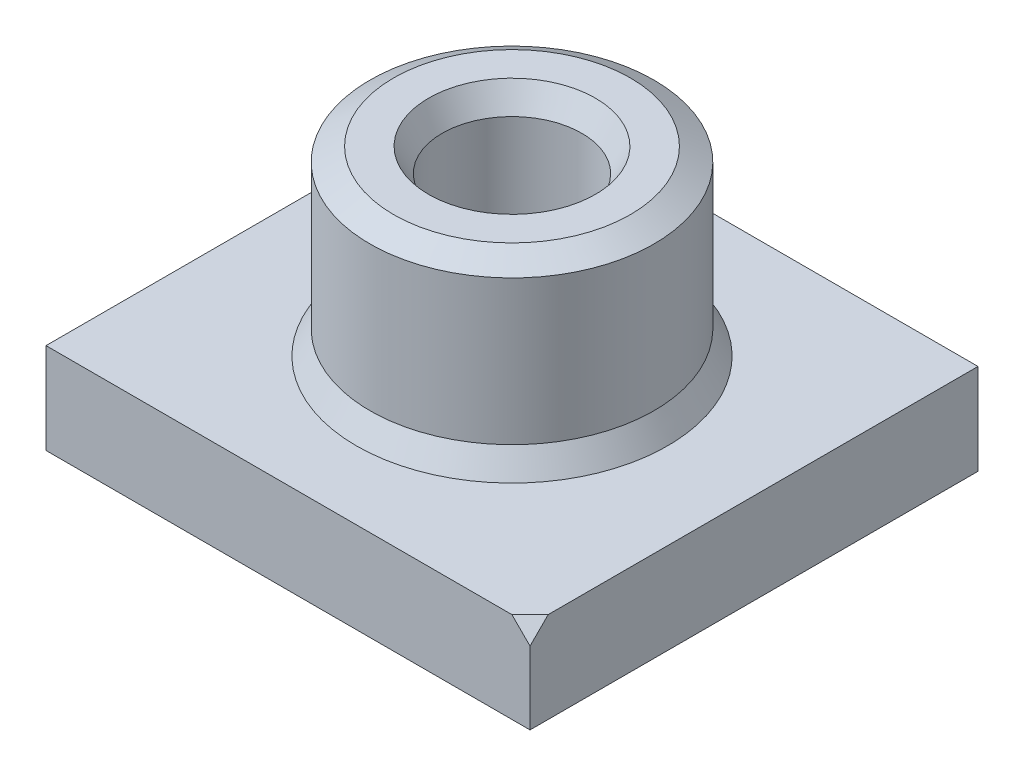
ISO-10303-21;
HEADER;
FILE_DESCRIPTION(('STEP AP214'),'2;1');
FILE_NAME('part.step','',(''),(''),'','','');
FILE_SCHEMA(('AUTOMOTIVE_DESIGN { 1 0 10303 214 1 1 1 1 }'));
ENDSEC;
DATA;
#1=APPLICATION_CONTEXT('core data for automotive mechanical design processes');
#2=APPLICATION_PROTOCOL_DEFINITION('international standard','automotive_design',2000,#1);
#3=PRODUCT_CONTEXT('',#1,'mechanical');
#4=PRODUCT('Part','Part','',(#3));
#5=PRODUCT_RELATED_PRODUCT_CATEGORY('part','',(#4));
#6=PRODUCT_DEFINITION_FORMATION('','',#4);
#7=PRODUCT_DEFINITION_CONTEXT('part definition',#1,'design');
#8=PRODUCT_DEFINITION('design','',#6,#7);
#9=PRODUCT_DEFINITION_SHAPE('','',#8);
#10=(LENGTH_UNIT() NAMED_UNIT(*) SI_UNIT(.MILLI.,.METRE.));
#11=(NAMED_UNIT(*) PLANE_ANGLE_UNIT() SI_UNIT($,.RADIAN.));
#12=(NAMED_UNIT(*) SI_UNIT($,.STERADIAN.) SOLID_ANGLE_UNIT());
#13=UNCERTAINTY_MEASURE_WITH_UNIT(LENGTH_MEASURE(1.E-05),#10,'distance_accuracy_value','');
#14=(GEOMETRIC_REPRESENTATION_CONTEXT(3) GLOBAL_UNCERTAINTY_ASSIGNED_CONTEXT((#13)) GLOBAL_UNIT_ASSIGNED_CONTEXT((#10,
#11,#12)) REPRESENTATION_CONTEXT('',''));
#15=CARTESIAN_POINT('',(0.,0.,0.));
#16=DIRECTION('',(0.,0.,1.));
#17=DIRECTION('',(1.,0.,0.));
#18=AXIS2_PLACEMENT_3D('',#15,#16,#17);
#19=CARTESIAN_POINT('',(67.6797797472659,25.4,-62.6367580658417));
#20=DIRECTION('',(-1.,0.,0.));
#21=DIRECTION('',(0.,0.,1.));
#22=AXIS2_PLACEMENT_3D('',#19,#20,#21);
#23=PLANE('',#22);
#24=DIRECTION('',(0.,0.,-1.));
#25=VECTOR('',#24,1.);
#26=CARTESIAN_POINT('',(67.6797797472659,25.4,-62.6367580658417));
#27=LINE('',#26,#25);
#28=CARTESIAN_POINT('',(67.6797797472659,25.4,57.5567580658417));
#29=VERTEX_POINT('',#28);
#30=CARTESIAN_POINT('',(67.6797797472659,25.4,-62.6367580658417));
#31=VERTEX_POINT('',#30);
#32=EDGE_CURVE('E83',#29,#31,#27,.T.);
#33=ORIENTED_EDGE('',*,*,#32,.F.);
#34=DIRECTION('',(0.,-0.707106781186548,0.707106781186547));
#35=VECTOR('',#34,1.);
#36=CARTESIAN_POINT('',(67.6797797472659,85.4967580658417,-2.53999999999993));
#37=LINE('',#36,#35);
#38=CARTESIAN_POINT('',(67.6797797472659,20.32,62.6367580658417));
#39=VERTEX_POINT('',#38);
#40=EDGE_CURVE('E72',#29,#39,#37,.T.);
#41=ORIENTED_EDGE('',*,*,#40,.T.);
#42=DIRECTION('',(0.,-1.,0.));
#43=VECTOR('',#42,1.);
#44=CARTESIAN_POINT('',(67.6797797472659,25.4,62.6367580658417));
#45=LINE('',#44,#43);
#46=CARTESIAN_POINT('',(67.6797797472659,0.,62.6367580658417));
#47=VERTEX_POINT('',#46);
#48=EDGE_CURVE('E100',#39,#47,#45,.T.);
#49=ORIENTED_EDGE('',*,*,#48,.T.);
#50=DIRECTION('',(0.,0.,-1.));
#51=VECTOR('',#50,1.);
#52=CARTESIAN_POINT('',(67.6797797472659,0.,-62.6367580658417));
#53=LINE('',#52,#51);
#54=CARTESIAN_POINT('',(67.6797797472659,0.,-62.6367580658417));
#55=VERTEX_POINT('',#54);
#56=EDGE_CURVE('E157',#47,#55,#53,.T.);
#57=ORIENTED_EDGE('',*,*,#56,.T.);
#58=DIRECTION('',(0.,-1.,0.));
#59=VECTOR('',#58,1.);
#60=CARTESIAN_POINT('',(67.6797797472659,25.4,-62.6367580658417));
#61=LINE('',#60,#59);
#62=EDGE_CURVE('E89',#31,#55,#61,.T.);
#63=ORIENTED_EDGE('',*,*,#62,.F.);
#64=EDGE_LOOP('',(#33,#41,#49,#57,#63));
#65=FACE_BOUND('',#64,.T.);
#66=ADVANCED_FACE('F27',(#65),#23,.F.);
#67=CARTESIAN_POINT('',(-67.6797797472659,25.4,62.6367580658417));
#68=DIRECTION('',(0.,0.,-1.));
#69=DIRECTION('',(-1.,0.,0.));
#70=AXIS2_PLACEMENT_3D('',#67,#68,#69);
#71=PLANE('',#70);
#72=ORIENTED_EDGE('',*,*,#48,.F.);
#73=DIRECTION('',(-0.707106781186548,0.707106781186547,0.));
#74=VECTOR('',#73,1.);
#75=CARTESIAN_POINT('',(-2.54000000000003,90.5397797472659,62.6367580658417));
#76=LINE('',#75,#74);
#77=CARTESIAN_POINT('',(62.5997797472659,25.4,62.6367580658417));
#78=VERTEX_POINT('',#77);
#79=EDGE_CURVE('E42',#39,#78,#76,.T.);
#80=ORIENTED_EDGE('',*,*,#79,.T.);
#81=DIRECTION('',(1.,0.,0.));
#82=VECTOR('',#81,1.);
#83=CARTESIAN_POINT('',(-67.6797797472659,25.4,62.6367580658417));
#84=LINE('',#83,#82);
#85=CARTESIAN_POINT('',(-67.6797797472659,25.4,62.6367580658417));
#86=VERTEX_POINT('',#85);
#87=EDGE_CURVE('E85',#86,#78,#84,.T.);
#88=ORIENTED_EDGE('',*,*,#87,.F.);
#89=DIRECTION('',(0.,-1.,0.));
#90=VECTOR('',#89,1.);
#91=CARTESIAN_POINT('',(-67.6797797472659,25.4,62.6367580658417));
#92=LINE('',#91,#90);
#93=CARTESIAN_POINT('',(-67.6797797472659,0.,62.6367580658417));
#94=VERTEX_POINT('',#93);
#95=EDGE_CURVE('E86',#86,#94,#92,.T.);
#96=ORIENTED_EDGE('',*,*,#95,.T.);
#97=DIRECTION('',(1.,0.,0.));
#98=VECTOR('',#97,1.);
#99=CARTESIAN_POINT('',(-67.6797797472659,0.,62.6367580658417));
#100=LINE('',#99,#98);
#101=EDGE_CURVE('E152',#94,#47,#100,.T.);
#102=ORIENTED_EDGE('',*,*,#101,.T.);
#103=EDGE_LOOP('',(#72,#80,#88,#96,#102));
#104=FACE_BOUND('',#103,.T.);
#105=ADVANCED_FACE('F165',(#104),#71,.F.);
#106=CARTESIAN_POINT('',(-67.6797797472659,25.4,62.6367580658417));
#107=DIRECTION('',(0.,1.,0.));
#108=DIRECTION('',(0.,0.,1.));
#109=AXIS2_PLACEMENT_3D('',#106,#107,#108);
#110=PLANE('',#109);
#111=CARTESIAN_POINT('',(0.,25.4,0.));
#112=DIRECTION('',(0.,1.,0.));
#113=DIRECTION('',(0.,0.,1.));
#114=AXIS2_PLACEMENT_3D('',#111,#112,#113);
#115=CIRCLE('',#114,43.5228953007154);
#116=CARTESIAN_POINT('',(0.,25.4,-43.5228953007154));
#117=VERTEX_POINT('',#116);
#118=EDGE_CURVE('E107',#117,#117,#115,.F.);
#119=ORIENTED_EDGE('',*,*,#118,.T.);
#120=EDGE_LOOP('',(#119));
#121=FACE_BOUND('',#120,.T.);
#122=DIRECTION('',(-0.707106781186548,0.,0.707106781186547));
#123=VECTOR('',#122,1.);
#124=CARTESIAN_POINT('',(-2.5400000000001,25.4,127.776537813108));
#125=LINE('',#124,#123);
#126=EDGE_CURVE('E75',#29,#78,#125,.T.);
#127=ORIENTED_EDGE('',*,*,#126,.F.);
#128=ORIENTED_EDGE('',*,*,#32,.T.);
#129=DIRECTION('',(-1.,0.,0.));
#130=VECTOR('',#129,1.);
#131=CARTESIAN_POINT('',(-67.6797797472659,25.4,-62.6367580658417));
#132=LINE('',#131,#130);
#133=CARTESIAN_POINT('',(-67.6797797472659,25.4,-62.6367580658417));
#134=VERTEX_POINT('',#133);
#135=EDGE_CURVE('E50',#31,#134,#132,.T.);
#136=ORIENTED_EDGE('',*,*,#135,.T.);
#137=DIRECTION('',(0.,0.,1.));
#138=VECTOR('',#137,1.);
#139=CARTESIAN_POINT('',(-67.6797797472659,25.4,-62.6367580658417));
#140=LINE('',#139,#138);
#141=EDGE_CURVE('E93',#134,#86,#140,.T.);
#142=ORIENTED_EDGE('',*,*,#141,.T.);
#143=ORIENTED_EDGE('',*,*,#87,.T.);
#144=EDGE_LOOP('',(#127,#128,#136,#142,#143));
#145=FACE_BOUND('',#144,.T.);
#146=ADVANCED_FACE('F82',(#121,#145),#110,.T.);
#147=CARTESIAN_POINT('',(-67.6797797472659,25.4,-62.6367580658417));
#148=DIRECTION('',(1.,0.,0.));
#149=DIRECTION('',(0.,0.,-1.));
#150=AXIS2_PLACEMENT_3D('',#147,#148,#149);
#151=PLANE('',#150);
#152=DIRECTION('',(0.,0.,1.));
#153=VECTOR('',#152,1.);
#154=CARTESIAN_POINT('',(-67.6797797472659,0.,-62.6367580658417));
#155=LINE('',#154,#153);
#156=CARTESIAN_POINT('',(-67.6797797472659,0.,-62.6367580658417));
#157=VERTEX_POINT('',#156);
#158=EDGE_CURVE('E149',#157,#94,#155,.T.);
#159=ORIENTED_EDGE('',*,*,#158,.T.);
#160=ORIENTED_EDGE('',*,*,#95,.F.);
#161=ORIENTED_EDGE('',*,*,#141,.F.);
#162=DIRECTION('',(0.,-1.,0.));
#163=VECTOR('',#162,1.);
#164=CARTESIAN_POINT('',(-67.6797797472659,25.4,-62.6367580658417));
#165=LINE('',#164,#163);
#166=EDGE_CURVE('E91',#134,#157,#165,.T.);
#167=ORIENTED_EDGE('',*,*,#166,.T.);
#168=EDGE_LOOP('',(#159,#160,#161,#167));
#169=FACE_BOUND('',#168,.T.);
#170=ADVANCED_FACE('F29',(#169),#151,.F.);
#171=CARTESIAN_POINT('',(-67.6797797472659,25.4,-62.6367580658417));
#172=DIRECTION('',(0.,0.,1.));
#173=DIRECTION('',(1.,0.,0.));
#174=AXIS2_PLACEMENT_3D('',#171,#172,#173);
#175=PLANE('',#174);
#176=DIRECTION('',(-1.,0.,0.));
#177=VECTOR('',#176,1.);
#178=CARTESIAN_POINT('',(-67.6797797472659,0.,-62.6367580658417));
#179=LINE('',#178,#177);
#180=EDGE_CURVE('E159',#55,#157,#179,.T.);
#181=ORIENTED_EDGE('',*,*,#180,.T.);
#182=ORIENTED_EDGE('',*,*,#166,.F.);
#183=ORIENTED_EDGE('',*,*,#135,.F.);
#184=ORIENTED_EDGE('',*,*,#62,.T.);
#185=EDGE_LOOP('',(#181,#182,#183,#184));
#186=FACE_BOUND('',#185,.T.);
#187=ADVANCED_FACE('F170',(#186),#175,.F.);
#188=CARTESIAN_POINT('',(-67.6797797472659,0.,62.6367580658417));
#189=DIRECTION('',(0.,1.,0.));
#190=DIRECTION('',(0.,0.,1.));
#191=AXIS2_PLACEMENT_3D('',#188,#189,#190);
#192=PLANE('',#191);
#193=ORIENTED_EDGE('',*,*,#158,.F.);
#194=ORIENTED_EDGE('',*,*,#180,.F.);
#195=ORIENTED_EDGE('',*,*,#56,.F.);
#196=ORIENTED_EDGE('',*,*,#101,.F.);
#197=EDGE_LOOP('',(#193,#194,#195,#196));
#198=FACE_BOUND('',#197,.T.);
#199=ADVANCED_FACE('F171',(#198),#192,.F.);
#200=CARTESIAN_POINT('',(0.,76.2,0.));
#201=DIRECTION('',(0.,-1.,0.));
#202=DIRECTION('',(0.,0.,-1.));
#203=AXIS2_PLACEMENT_3D('',#200,#201,#202);
#204=CYLINDRICAL_SURFACE('',#203,39.7128953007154);
#205=CARTESIAN_POINT('',(0.,72.39,0.));
#206=DIRECTION('',(0.,1.,0.));
#207=DIRECTION('',(0.,0.,1.));
#208=AXIS2_PLACEMENT_3D('',#205,#206,#207);
#209=CIRCLE('',#208,39.7128953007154);
#210=CARTESIAN_POINT('',(0.,72.39,-39.7128953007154));
#211=VERTEX_POINT('',#210);
#212=EDGE_CURVE('E35',#211,#211,#209,.F.);
#213=CARTESIAN_POINT('',(0.,31.9991135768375,0.));
#214=DIRECTION('',(0.,1.,0.));
#215=DIRECTION('',(0.,0.,1.));
#216=AXIS2_PLACEMENT_3D('',#213,#214,#215);
#217=CIRCLE('',#216,39.7128953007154);
#218=CARTESIAN_POINT('',(0.,31.9991135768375,-39.7128953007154));
#219=VERTEX_POINT('',#218);
#220=EDGE_CURVE('E79',#219,#219,#217,.T.);
#221=CARTESIAN_POINT('',(0.,72.39,-39.7128953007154));
#222=CARTESIAN_POINT('',(0.,71.9692615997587,-39.7128953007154));
#223=CARTESIAN_POINT('',(0.,71.5485231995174,-39.7128953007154));
#224=CARTESIAN_POINT('',(0.,70.7070463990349,-39.7128953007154));
#225=CARTESIAN_POINT('',(0.,70.2863079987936,-39.7128953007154));
#226=CARTESIAN_POINT('',(0.,69.4448311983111,-39.7128953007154));
#227=CARTESIAN_POINT('',(0.,69.0240927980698,-39.7128953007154));
#228=CARTESIAN_POINT('',(0.,68.1826159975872,-39.7128953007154));
#229=CARTESIAN_POINT('',(0.,67.7618775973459,-39.7128953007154));
#230=CARTESIAN_POINT('',(0.,66.9204007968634,-39.7128953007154));
#231=CARTESIAN_POINT('',(0.,66.4996623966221,-39.7128953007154));
#232=CARTESIAN_POINT('',(0.,65.6581855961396,-39.7128953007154));
#233=CARTESIAN_POINT('',(0.,65.2374471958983,-39.7128953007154));
#234=CARTESIAN_POINT('',(0.,64.3959703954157,-39.7128953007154));
#235=CARTESIAN_POINT('',(0.,63.9752319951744,-39.7128953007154));
#236=CARTESIAN_POINT('',(0.,63.1337551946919,-39.7128953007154));
#237=CARTESIAN_POINT('',(0.,62.7130167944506,-39.7128953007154));
#238=CARTESIAN_POINT('',(0.,61.8715399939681,-39.7128953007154));
#239=CARTESIAN_POINT('',(0.,61.4508015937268,-39.7128953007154));
#240=CARTESIAN_POINT('',(0.,60.6093247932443,-39.7128953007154));
#241=CARTESIAN_POINT('',(0.,60.188586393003,-39.7128953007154));
#242=CARTESIAN_POINT('',(0.,59.3471095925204,-39.7128953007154));
#243=CARTESIAN_POINT('',(0.,58.9263711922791,-39.7128953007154));
#244=CARTESIAN_POINT('',(0.,58.0848943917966,-39.7128953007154));
#245=CARTESIAN_POINT('',(0.,57.6641559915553,-39.7128953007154));
#246=CARTESIAN_POINT('',(0.,56.8226791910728,-39.7128953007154));
#247=CARTESIAN_POINT('',(0.,56.4019407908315,-39.7128953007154));
#248=CARTESIAN_POINT('',(0.,55.5604639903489,-39.7128953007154));
#249=CARTESIAN_POINT('',(0.,55.1397255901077,-39.7128953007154));
#250=CARTESIAN_POINT('',(0.,54.2982487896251,-39.7128953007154));
#251=CARTESIAN_POINT('',(0.,53.8775103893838,-39.7128953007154));
#252=CARTESIAN_POINT('',(0.,53.0360335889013,-39.7128953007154));
#253=CARTESIAN_POINT('',(0.,52.61529518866,-39.7128953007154));
#254=CARTESIAN_POINT('',(0.,51.7738183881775,-39.7128953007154));
#255=CARTESIAN_POINT('',(0.,51.3530799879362,-39.7128953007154));
#256=CARTESIAN_POINT('',(0.,50.5116031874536,-39.7128953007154));
#257=CARTESIAN_POINT('',(0.,50.0908647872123,-39.7128953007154));
#258=CARTESIAN_POINT('',(0.,49.2493879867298,-39.7128953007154));
#259=CARTESIAN_POINT('',(0.,48.8286495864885,-39.7128953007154));
#260=CARTESIAN_POINT('',(0.,47.987172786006,-39.7128953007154));
#261=CARTESIAN_POINT('',(0.,47.5664343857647,-39.7128953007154));
#262=CARTESIAN_POINT('',(0.,46.7249575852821,-39.7128953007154));
#263=CARTESIAN_POINT('',(0.,46.3042191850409,-39.7128953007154));
#264=CARTESIAN_POINT('',(0.,45.4627423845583,-39.7128953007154));
#265=CARTESIAN_POINT('',(0.,45.042003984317,-39.7128953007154));
#266=CARTESIAN_POINT('',(0.,44.2005271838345,-39.7128953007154));
#267=CARTESIAN_POINT('',(0.,43.7797887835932,-39.7128953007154));
#268=CARTESIAN_POINT('',(0.,42.9383119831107,-39.7128953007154));
#269=CARTESIAN_POINT('',(0.,42.5175735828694,-39.7128953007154));
#270=CARTESIAN_POINT('',(0.,41.6760967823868,-39.7128953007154));
#271=CARTESIAN_POINT('',(0.,41.2553583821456,-39.7128953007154));
#272=CARTESIAN_POINT('',(0.,40.413881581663,-39.7128953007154));
#273=CARTESIAN_POINT('',(0.,39.9931431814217,-39.7128953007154));
#274=CARTESIAN_POINT('',(0.,39.1516663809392,-39.7128953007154));
#275=CARTESIAN_POINT('',(0.,38.7309279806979,-39.7128953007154));
#276=CARTESIAN_POINT('',(0.,37.8894511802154,-39.7128953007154));
#277=CARTESIAN_POINT('',(0.,37.4687127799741,-39.7128953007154));
#278=CARTESIAN_POINT('',(0.,36.6272359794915,-39.7128953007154));
#279=CARTESIAN_POINT('',(0.,36.2064975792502,-39.7128953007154));
#280=CARTESIAN_POINT('',(0.,35.3650207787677,-39.7128953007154));
#281=CARTESIAN_POINT('',(0.,34.9442823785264,-39.7128953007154));
#282=CARTESIAN_POINT('',(0.,34.1028055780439,-39.7128953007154));
#283=CARTESIAN_POINT('',(0.,33.6820671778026,-39.7128953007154));
#284=CARTESIAN_POINT('',(0.,32.84059037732,-39.7128953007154));
#285=CARTESIAN_POINT('',(0.,32.4198519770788,-39.7128953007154));
#286=CARTESIAN_POINT('',(0.,31.9991135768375,-39.7128953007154));
#287=B_SPLINE_CURVE_WITH_KNOTS('',3,(#221,#222,#223,#224,#225,#226,#227,#228,#229,#230,#231,
#232,#233,#234,#235,#236,#237,#238,#239,#240,#241,#242,#243,#244,#245,#246,#247,#248,#249,#250,
#251,#252,#253,#254,#255,#256,#257,#258,#259,#260,#261,#262,#263,#264,#265,#266,#267,#268,#269,
#270,#271,#272,#273,#274,#275,#276,#277,#278,#279,#280,#281,#282,#283,#284,#285,#286),
.UNSPECIFIED.,.F.,.F.,(4,2,2,2,2,2,2,2,2,2,2,2,2,2,2,2,2,2,2,2,2,2,2,2,2,2,2,2,2,2,2,2,4),(0.,
1.26221520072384,2.52443040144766,3.78664560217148,5.04886080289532,6.31107600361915,
7.57329120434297,8.83550640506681,10.0977216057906,11.3599368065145,12.6221520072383,
13.8843672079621,15.1465824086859,16.4087976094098,17.6710128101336,18.9332280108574,
20.1954432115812,21.4576584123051,22.7198736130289,23.9820888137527,25.2443040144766,
26.5065192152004,27.7687344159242,29.030949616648,30.2931648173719,31.5553800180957,
32.8175952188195,34.0798104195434,35.3420256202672,36.604240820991,37.8664560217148,
39.1286712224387,40.3908864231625),.UNSPECIFIED.);
#288=EDGE_CURVE('BSEAM118',#211,#219,#287,.T.);
#289=ORIENTED_EDGE('',*,*,#212,.T.);
#290=ORIENTED_EDGE('',*,*,#220,.T.);
#291=ORIENTED_EDGE('',*,*,#288,.T.);
#292=ORIENTED_EDGE('',*,*,#288,.F.);
#293=EDGE_LOOP('',(#289,#291,#290,#292));
#294=FACE_BOUND('',#293,.T.);
#295=ADVANCED_FACE('F118',(#294),#204,.T.);
#296=CARTESIAN_POINT('',(0.,76.2,0.));
#297=DIRECTION('',(0.,1.,0.));
#298=DIRECTION('',(0.,0.,1.));
#299=AXIS2_PLACEMENT_3D('',#296,#297,#298);
#300=PLANE('',#299);
#301=CARTESIAN_POINT('',(0.,76.2,0.));
#302=DIRECTION('',(0.,1.,0.));
#303=DIRECTION('',(0.,0.,1.));
#304=AXIS2_PLACEMENT_3D('',#301,#302,#303);
#305=CIRCLE('',#304,33.113781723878);
#306=CARTESIAN_POINT('',(0.,76.2,-33.113781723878));
#307=VERTEX_POINT('',#306);
#308=EDGE_CURVE('E113',#307,#307,#305,.T.);
#309=ORIENTED_EDGE('',*,*,#308,.T.);
#310=EDGE_LOOP('',(#309));
#311=FACE_BOUND('',#310,.T.);
#312=CARTESIAN_POINT('',(0.,76.2,0.));
#313=DIRECTION('',(0.,1.,0.));
#314=DIRECTION('',(0.,0.,1.));
#315=AXIS2_PLACEMENT_3D('',#312,#313,#314);
#316=CIRCLE('',#315,23.3291068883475);
#317=CARTESIAN_POINT('',(0.,76.2,23.3291068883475));
#318=VERTEX_POINT('',#317);
#319=EDGE_CURVE('E110',#318,#318,#316,.F.);
#320=ORIENTED_EDGE('',*,*,#319,.T.);
#321=EDGE_LOOP('',(#320));
#322=FACE_BOUND('',#321,.T.);
#323=ADVANCED_FACE('F129',(#311,#322),#300,.T.);
#324=CARTESIAN_POINT('',(0.,-29.8083713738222,0.));
#325=DIRECTION('',(0.,1.,0.));
#326=DIRECTION('',(0.,0.,1.));
#327=AXIS2_PLACEMENT_3D('',#324,#325,#326);
#328=CYLINDRICAL_SURFACE('',#327,19.5191068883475);
#329=CARTESIAN_POINT('',(0.,69.6008864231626,0.));
#330=DIRECTION('',(0.,1.,0.));
#331=DIRECTION('',(0.,0.,1.));
#332=AXIS2_PLACEMENT_3D('',#329,#330,#331);
#333=CIRCLE('',#332,19.5191068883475);
#334=CARTESIAN_POINT('',(0.,69.6008864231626,19.5191068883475));
#335=VERTEX_POINT('',#334);
#336=EDGE_CURVE('E11',#335,#335,#333,.T.);
#337=ORIENTED_EDGE('',*,*,#336,.T.);
#338=EDGE_LOOP('',(#337));
#339=FACE_BOUND('',#338,.T.);
#340=CARTESIAN_POINT('',(0.,25.4,0.));
#341=DIRECTION('',(0.,1.,0.));
#342=DIRECTION('',(0.,0.,1.));
#343=AXIS2_PLACEMENT_3D('',#340,#341,#342);
#344=CIRCLE('',#343,19.5191068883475);
#345=CARTESIAN_POINT('',(0.,25.4,19.5191068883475));
#346=VERTEX_POINT('',#345);
#347=EDGE_CURVE('E147',#346,#346,#344,.F.);
#348=ORIENTED_EDGE('',*,*,#347,.T.);
#349=EDGE_LOOP('',(#348));
#350=FACE_BOUND('',#349,.T.);
#351=ADVANCED_FACE('F132',(#339,#350),#328,.F.);
#352=CARTESIAN_POINT('',(-67.6797797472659,25.4,62.6367580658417));
#353=DIRECTION('',(0.,1.,0.));
#354=DIRECTION('',(0.,0.,1.));
#355=AXIS2_PLACEMENT_3D('',#352,#353,#354);
#356=PLANE('',#355);
#357=ORIENTED_EDGE('',*,*,#347,.F.);
#358=EDGE_LOOP('',(#357));
#359=FACE_BOUND('',#358,.T.);
#360=ADVANCED_FACE('F143',(#359),#356,.T.);
#361=CARTESIAN_POINT('',(67.6967130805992,25.4169333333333,57.522891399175));
#362=DIRECTION('',(-0.577350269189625,-0.577350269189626,-0.577350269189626));
#363=DIRECTION('',(0.,0.707106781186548,-0.707106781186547));
#364=AXIS2_PLACEMENT_3D('',#361,#362,#363);
#365=PLANE('',#364);
#366=ORIENTED_EDGE('',*,*,#40,.F.);
#367=ORIENTED_EDGE('',*,*,#126,.T.);
#368=ORIENTED_EDGE('',*,*,#79,.F.);
#369=EDGE_LOOP('',(#366,#367,#368));
#370=FACE_BOUND('',#369,.T.);
#371=ADVANCED_FACE('F74',(#370),#365,.F.);
#372=CARTESIAN_POINT('',(0.,31.9991135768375,0.));
#373=DIRECTION('',(0.,-1.,0.));
#374=DIRECTION('',(0.,0.,-1.));
#375=AXIS2_PLACEMENT_3D('',#372,#373,#374);
#376=CONICAL_SURFACE('',#375,39.7128953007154,0.523598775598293);
#377=CARTESIAN_POINT('',(0.,25.4,-43.5228953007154));
#378=CARTESIAN_POINT('',(0.,25.4687407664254,-43.4832078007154));
#379=CARTESIAN_POINT('',(0.,25.5374815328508,-43.4435203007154));
#380=CARTESIAN_POINT('',(0.,25.6749630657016,-43.3641453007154));
#381=CARTESIAN_POINT('',(0.,25.743703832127,-43.3244578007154));
#382=CARTESIAN_POINT('',(0.,25.8811853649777,-43.2450828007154));
#383=CARTESIAN_POINT('',(0.,25.9499261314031,-43.2053953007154));
#384=CARTESIAN_POINT('',(0.,26.0874076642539,-43.1260203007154));
#385=CARTESIAN_POINT('',(0.,26.1561484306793,-43.0863328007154));
#386=CARTESIAN_POINT('',(0.,26.2936299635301,-43.0069578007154));
#387=CARTESIAN_POINT('',(0.,26.3623707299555,-42.9672703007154));
#388=CARTESIAN_POINT('',(0.,26.4998522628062,-42.8878953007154));
#389=CARTESIAN_POINT('',(0.,26.5685930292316,-42.8482078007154));
#390=CARTESIAN_POINT('',(0.,26.7060745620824,-42.7688328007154));
#391=CARTESIAN_POINT('',(0.,26.7748153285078,-42.7291453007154));
#392=CARTESIAN_POINT('',(0.,26.9122968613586,-42.6497703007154));
#393=CARTESIAN_POINT('',(0.,26.981037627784,-42.6100828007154));
#394=CARTESIAN_POINT('',(0.,27.1185191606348,-42.5307078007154));
#395=CARTESIAN_POINT('',(0.,27.1872599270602,-42.4910203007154));
#396=CARTESIAN_POINT('',(0.,27.3247414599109,-42.4116453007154));
#397=CARTESIAN_POINT('',(0.,27.3934822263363,-42.3719578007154));
#398=CARTESIAN_POINT('',(0.,27.5309637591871,-42.2925828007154));
#399=CARTESIAN_POINT('',(0.,27.5997045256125,-42.2528953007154));
#400=CARTESIAN_POINT('',(0.,27.7371860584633,-42.1735203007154));
#401=CARTESIAN_POINT('',(0.,27.8059268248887,-42.1338328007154));
#402=CARTESIAN_POINT('',(0.,27.9434083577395,-42.0544578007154));
#403=CARTESIAN_POINT('',(0.,28.0121491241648,-42.0147703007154));
#404=CARTESIAN_POINT('',(0.,28.1496306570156,-41.9353953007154));
#405=CARTESIAN_POINT('',(0.,28.218371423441,-41.8957078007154));
#406=CARTESIAN_POINT('',(0.,28.3558529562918,-41.8163328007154));
#407=CARTESIAN_POINT('',(0.,28.4245937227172,-41.7766453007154));
#408=CARTESIAN_POINT('',(0.,28.562075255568,-41.6972703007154));
#409=CARTESIAN_POINT('',(0.,28.6308160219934,-41.6575828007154));
#410=CARTESIAN_POINT('',(0.,28.7682975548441,-41.5782078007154));
#411=CARTESIAN_POINT('',(0.,28.8370383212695,-41.5385203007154));
#412=CARTESIAN_POINT('',(0.,28.9745198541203,-41.4591453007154));
#413=CARTESIAN_POINT('',(0.,29.0432606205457,-41.4194578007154));
#414=CARTESIAN_POINT('',(0.,29.1807421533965,-41.3400828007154));
#415=CARTESIAN_POINT('',(0.,29.2494829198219,-41.3003953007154));
#416=CARTESIAN_POINT('',(0.,29.3869644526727,-41.2210203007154));
#417=CARTESIAN_POINT('',(0.,29.455705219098,-41.1813328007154));
#418=CARTESIAN_POINT('',(0.,29.5931867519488,-41.1019578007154));
#419=CARTESIAN_POINT('',(0.,29.6619275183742,-41.0622703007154));
#420=CARTESIAN_POINT('',(0.,29.799409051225,-40.9828953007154));
#421=CARTESIAN_POINT('',(0.,29.8681498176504,-40.9432078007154));
#422=CARTESIAN_POINT('',(0.,30.0056313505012,-40.8638328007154));
#423=CARTESIAN_POINT('',(0.,30.0743721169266,-40.8241453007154));
#424=CARTESIAN_POINT('',(0.,30.2118536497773,-40.7447703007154));
#425=CARTESIAN_POINT('',(0.,30.2805944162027,-40.7050828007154));
#426=CARTESIAN_POINT('',(0.,30.4180759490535,-40.6257078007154));
#427=CARTESIAN_POINT('',(0.,30.4868167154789,-40.5860203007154));
#428=CARTESIAN_POINT('',(0.,30.6242982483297,-40.5066453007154));
#429=CARTESIAN_POINT('',(0.,30.6930390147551,-40.4669578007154));
#430=CARTESIAN_POINT('',(0.,30.8305205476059,-40.3875828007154));
#431=CARTESIAN_POINT('',(0.,30.8992613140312,-40.3478953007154));
#432=CARTESIAN_POINT('',(0.,31.036742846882,-40.2685203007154));
#433=CARTESIAN_POINT('',(0.,31.1054836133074,-40.2288328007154));
#434=CARTESIAN_POINT('',(0.,31.2429651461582,-40.1494578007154));
#435=CARTESIAN_POINT('',(0.,31.3117059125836,-40.1097703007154));
#436=CARTESIAN_POINT('',(0.,31.4491874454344,-40.0303953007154));
#437=CARTESIAN_POINT('',(0.,31.5179282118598,-39.9907078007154));
#438=CARTESIAN_POINT('',(0.,31.6554097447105,-39.9113328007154));
#439=CARTESIAN_POINT('',(0.,31.7241505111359,-39.8716453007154));
#440=CARTESIAN_POINT('',(0.,31.8616320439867,-39.7922703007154));
#441=CARTESIAN_POINT('',(0.,31.9303728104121,-39.7525828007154));
#442=CARTESIAN_POINT('',(0.,31.9991135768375,-39.7128953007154));
#443=B_SPLINE_CURVE_WITH_KNOTS('',3,(#377,#378,#379,#380,#381,#382,#383,#384,#385,#386,#387,
#388,#389,#390,#391,#392,#393,#394,#395,#396,#397,#398,#399,#400,#401,#402,#403,#404,#405,#406,
#407,#408,#409,#410,#411,#412,#413,#414,#415,#416,#417,#418,#419,#420,#421,#422,#423,#424,#425,
#426,#427,#428,#429,#430,#431,#432,#433,#434,#435,#436,#437,#438,#439,#440,#441,#442),
.UNSPECIFIED.,.F.,.F.,(4,2,2,2,2,2,2,2,2,2,2,2,2,2,2,2,2,2,2,2,2,2,2,2,2,2,2,2,2,2,2,2,4),(0.,
0.238125,0.476250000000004,0.714375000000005,0.952500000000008,1.19062500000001,
1.42875000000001,1.66687500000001,1.90500000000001,2.14312500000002,2.38125000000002,
2.61937500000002,2.85750000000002,3.09562500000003,3.33375000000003,3.57187500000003,
3.81000000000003,4.04812500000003,4.28625000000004,4.52437500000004,4.76250000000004,
5.00062500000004,5.23875000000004,5.47687500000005,5.71500000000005,5.95312500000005,
6.19125000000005,6.42937500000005,6.66750000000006,6.90562500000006,7.14375000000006,
7.38187500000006,7.62000000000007),.UNSPECIFIED.);
#444=EDGE_CURVE('BSEAM125',#117,#219,#443,.T.);
#445=ORIENTED_EDGE('',*,*,#118,.F.);
#446=ORIENTED_EDGE('',*,*,#220,.F.);
#447=ORIENTED_EDGE('',*,*,#444,.T.);
#448=ORIENTED_EDGE('',*,*,#444,.F.);
#449=EDGE_LOOP('',(#445,#447,#446,#448));
#450=FACE_BOUND('',#449,.T.);
#451=ADVANCED_FACE('F125',(#450),#376,.T.);
#452=CARTESIAN_POINT('',(0.,76.2,0.));
#453=DIRECTION('',(0.,-1.,0.));
#454=DIRECTION('',(0.,0.,-1.));
#455=AXIS2_PLACEMENT_3D('',#452,#453,#454);
#456=CONICAL_SURFACE('',#455,33.113781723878,1.04719755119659);
#457=CARTESIAN_POINT('',(0.,72.39,-39.7128953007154));
#458=CARTESIAN_POINT('',(0.,72.4296875,-39.64415453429));
#459=CARTESIAN_POINT('',(0.,72.469375,-39.5754137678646));
#460=CARTESIAN_POINT('',(0.,72.54875,-39.4379322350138));
#461=CARTESIAN_POINT('',(0.,72.5884375,-39.3691914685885));
#462=CARTESIAN_POINT('',(0.,72.6678125,-39.2317099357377));
#463=CARTESIAN_POINT('',(0.,72.7075,-39.1629691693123));
#464=CARTESIAN_POINT('',(0.,72.786875,-39.0254876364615));
#465=CARTESIAN_POINT('',(0.,72.8265625,-38.9567468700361));
#466=CARTESIAN_POINT('',(0.,72.9059375,-38.8192653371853));
#467=CARTESIAN_POINT('',(0.,72.945625,-38.7505245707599));
#468=CARTESIAN_POINT('',(0.,73.025,-38.6130430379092));
#469=CARTESIAN_POINT('',(0.,73.0646875,-38.5443022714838));
#470=CARTESIAN_POINT('',(0.,73.1440625,-38.406820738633));
#471=CARTESIAN_POINT('',(0.,73.18375,-38.3380799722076));
#472=CARTESIAN_POINT('',(0.,73.263125,-38.2005984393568));
#473=CARTESIAN_POINT('',(0.,73.3028125,-38.1318576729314));
#474=CARTESIAN_POINT('',(0.,73.3821875,-37.9943761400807));
#475=CARTESIAN_POINT('',(0.,73.421875,-37.9256353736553));
#476=CARTESIAN_POINT('',(0.,73.50125,-37.7881538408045));
#477=CARTESIAN_POINT('',(0.,73.5409375,-37.7194130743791));
#478=CARTESIAN_POINT('',(0.,73.6203125,-37.5819315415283));
#479=CARTESIAN_POINT('',(0.,73.66,-37.5131907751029));
#480=CARTESIAN_POINT('',(0.,73.739375,-37.3757092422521));
#481=CARTESIAN_POINT('',(0.,73.7790625,-37.3069684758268));
#482=CARTESIAN_POINT('',(0.,73.8584375,-37.169486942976));
#483=CARTESIAN_POINT('',(0.,73.898125,-37.1007461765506));
#484=CARTESIAN_POINT('',(0.,73.9775,-36.9632646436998));
#485=CARTESIAN_POINT('',(0.,74.0171875,-36.8945238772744));
#486=CARTESIAN_POINT('',(0.,74.0965625,-36.7570423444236));
#487=CARTESIAN_POINT('',(0.,74.13625,-36.6883015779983));
#488=CARTESIAN_POINT('',(0.,74.215625,-36.5508200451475));
#489=CARTESIAN_POINT('',(0.,74.2553125,-36.4820792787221));
#490=CARTESIAN_POINT('',(0.,74.3346875,-36.3445977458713));
#491=CARTESIAN_POINT('',(0.,74.374375,-36.2758569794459));
#492=CARTESIAN_POINT('',(0.,74.45375,-36.1383754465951));
#493=CARTESIAN_POINT('',(0.,74.4934375,-36.0696346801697));
#494=CARTESIAN_POINT('',(0.,74.5728125,-35.932153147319));
#495=CARTESIAN_POINT('',(0.,74.6125,-35.8634123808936));
#496=CARTESIAN_POINT('',(0.,74.691875,-35.7259308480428));
#497=CARTESIAN_POINT('',(0.,74.7315625,-35.6571900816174));
#498=CARTESIAN_POINT('',(0.,74.8109375,-35.5197085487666));
#499=CARTESIAN_POINT('',(0.,74.850625,-35.4509677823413));
#500=CARTESIAN_POINT('',(0.,74.93,-35.3134862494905));
#501=CARTESIAN_POINT('',(0.,74.9696875,-35.2447454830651));
#502=CARTESIAN_POINT('',(0.,75.0490625,-35.1072639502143));
#503=CARTESIAN_POINT('',(0.,75.08875,-35.0385231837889));
#504=CARTESIAN_POINT('',(0.,75.168125,-34.9010416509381));
#505=CARTESIAN_POINT('',(0.,75.2078125,-34.8323008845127));
#506=CARTESIAN_POINT('',(0.,75.2871875,-34.694819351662));
#507=CARTESIAN_POINT('',(0.,75.326875,-34.6260785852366));
#508=CARTESIAN_POINT('',(0.,75.40625,-34.4885970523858));
#509=CARTESIAN_POINT('',(0.,75.4459375,-34.4198562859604));
#510=CARTESIAN_POINT('',(0.,75.5253125,-34.2823747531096));
#511=CARTESIAN_POINT('',(0.,75.565,-34.2136339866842));
#512=CARTESIAN_POINT('',(0.,75.644375,-34.0761524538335));
#513=CARTESIAN_POINT('',(0.,75.6840625,-34.0074116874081));
#514=CARTESIAN_POINT('',(0.,75.7634375,-33.8699301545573));
#515=CARTESIAN_POINT('',(0.,75.803125,-33.8011893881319));
#516=CARTESIAN_POINT('',(0.,75.8825,-33.6637078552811));
#517=CARTESIAN_POINT('',(0.,75.9221875,-33.5949670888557));
#518=CARTESIAN_POINT('',(0.,76.0015625,-33.457485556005));
#519=CARTESIAN_POINT('',(0.,76.04125,-33.3887447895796));
#520=CARTESIAN_POINT('',(0.,76.120625,-33.2512632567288));
#521=CARTESIAN_POINT('',(0.,76.1603125,-33.1825224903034));
#522=CARTESIAN_POINT('',(0.,76.2,-33.113781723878));
#523=B_SPLINE_CURVE_WITH_KNOTS('',3,(#457,#458,#459,#460,#461,#462,#463,#464,#465,#466,#467,
#468,#469,#470,#471,#472,#473,#474,#475,#476,#477,#478,#479,#480,#481,#482,#483,#484,#485,#486,
#487,#488,#489,#490,#491,#492,#493,#494,#495,#496,#497,#498,#499,#500,#501,#502,#503,#504,#505,
#506,#507,#508,#509,#510,#511,#512,#513,#514,#515,#516,#517,#518,#519,#520,#521,#522),
.UNSPECIFIED.,.F.,.F.,(4,2,2,2,2,2,2,2,2,2,2,2,2,2,2,2,2,2,2,2,2,2,2,2,2,2,2,2,2,2,2,2,4),(0.,
0.238124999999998,0.476250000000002,0.714375,0.952500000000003,1.190625,1.42875,1.666875,1.905,
2.143125,2.38125,2.61937499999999,2.85749999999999,3.09562499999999,3.33374999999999,3.571875,
3.80999999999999,4.04812499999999,4.28624999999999,4.52437499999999,4.76249999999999,
5.00062499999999,5.23874999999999,5.47687499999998,5.71499999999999,5.95312499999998,
6.19124999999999,6.42937499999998,6.66749999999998,6.90562499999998,7.14374999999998,
7.38187499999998,7.61999999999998),.UNSPECIFIED.);
#524=EDGE_CURVE('BSEAM121',#211,#307,#523,.T.);
#525=ORIENTED_EDGE('',*,*,#212,.F.);
#526=ORIENTED_EDGE('',*,*,#308,.F.);
#527=ORIENTED_EDGE('',*,*,#524,.T.);
#528=ORIENTED_EDGE('',*,*,#524,.F.);
#529=EDGE_LOOP('',(#525,#527,#526,#528));
#530=FACE_BOUND('',#529,.T.);
#531=ADVANCED_FACE('F121',(#530),#456,.T.);
#532=CARTESIAN_POINT('',(0.,69.6008864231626,0.));
#533=DIRECTION('',(0.,1.,0.));
#534=DIRECTION('',(0.,0.,1.));
#535=AXIS2_PLACEMENT_3D('',#532,#533,#534);
#536=CONICAL_SURFACE('',#535,19.5191068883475,0.5235987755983);
#537=ORIENTED_EDGE('',*,*,#319,.F.);
#538=EDGE_LOOP('',(#537));
#539=FACE_BOUND('',#538,.T.);
#540=ORIENTED_EDGE('',*,*,#336,.F.);
#541=EDGE_LOOP('',(#540));
#542=FACE_BOUND('',#541,.T.);
#543=ADVANCED_FACE('F124',(#539,#542),#536,.F.);
#544=CLOSED_SHELL('',(#66,#105,#146,#170,#187,#199,#295,#323,#351,#360,#371,#451,#531,#543));
#545=MANIFOLD_SOLID_BREP('B2',#544);
#546=ADVANCED_BREP_SHAPE_REPRESENTATION('',(#18,#545),#14);
#547=SHAPE_DEFINITION_REPRESENTATION(#9,#546);
ENDSEC;
END-ISO-10303-21;
